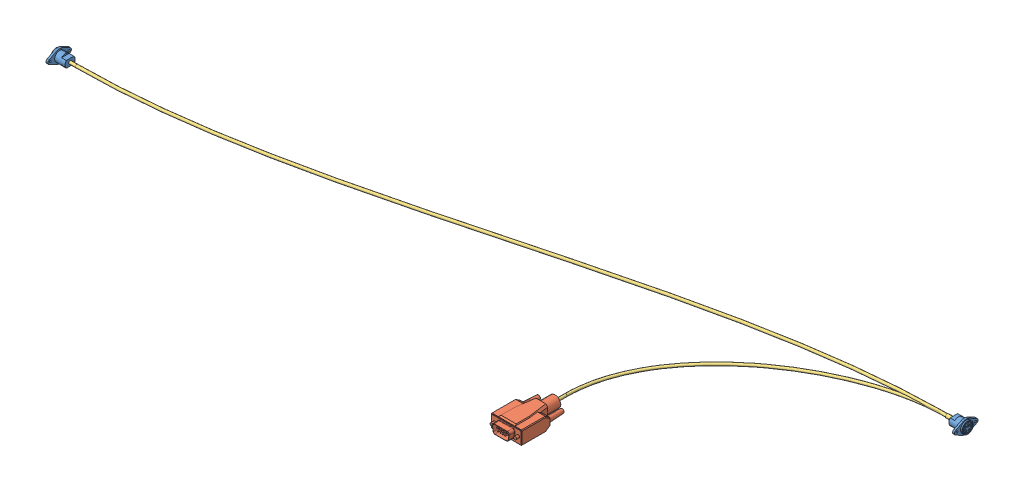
SolidWorks assembly Harness1-Signal control system_di.sldasm, configuration Default (file format 13000). Lengths in mm.
Overall size (758.95 98.49 243.41).
4 component instances, 3 part files, 7 mates.
Components (placement in the parent):
- socket-6pinmindin-1: socket-6pinmindin.sldprt [Default] at (191.94 -113.4819 -267.9635) x (0 0 -1) z (1 0 0) size (24.79 13.97 24.61)
- socket-6pinmindin-2: socket-6pinmindin.sldprt [Default] at (-563.964 -49.9819 -64.7635) x (0 0 1) z (-1 0 0) size (24.79 13.97 24.61)
- db9 male-1: db9 male.sldprt [Default] at (-68.5053 -133.6128 -43.0625) x (-1 0 0) z (0 0 1) size (32.5 15.75 67.41)
- Cable^Harness1-Signal control system_di-1: Cable^Harness1-Signal control system_di.SLDPRT [Default] at origin size (729.74 86.59 206.61) (virtual)
Mates (geometry in assembly coordinates):
- Concentric11: concentric: cylinder of socket-6pinmindin-1 through (193.464 -113.4819 -267.9635) axis (-1 0 0) radius 5.9944; cylinder of ? through (194.988 -113.4819 -267.9635) axis (-1 0 0) radius 6.35
- Coincident11: coincident: plane of socket-6pinmindin-1 through (191.94 -113.4819 -267.9635) normal (1 0 0); plane of ? through (191.94 -5.5319 -369.5635) normal (-1 0 0)
- Concentric21: concentric: cylinder of socket-6pinmindin-2 through (-565.488 -49.9819 -64.7635) axis (1 0 0) radius 5.9944; cylinder of ? through (194.988 -49.9819 -64.7635) axis (-1 0 0) radius 6.35
- Coincident21: coincident: plane of socket-6pinmindin-2 through (-563.964 -49.9819 -64.7635) normal (-1 0 0); plane of ? through (-563.964 -5.5319 -369.5635) normal (1 0 0)
- Parallel11: parallel: plane of db9 male-1 through (-61.5053 -129.1928 -42.9475) normal (0 -1 0); plane of ? through (-74.608 -129.5982 -42.9475) normal (0 1 0)
- Concentric31: concentric: cylinder of db9 male-1 through (-73.5053 -132.1128 -37.9475) axis (0 0 -1) radius 0.5; cylinder of ? through (-73.5053 -132.1128 -36.5975) axis (0 0 -1) radius 0.762
- Coincident31: coincident: plane of db9 male-1 through (-61.5053 -130.9428 -42.9475) normal (0 0 1); plane of ? through (-61.3282 -131.1222 -42.9475) normal (0 0 -1)
